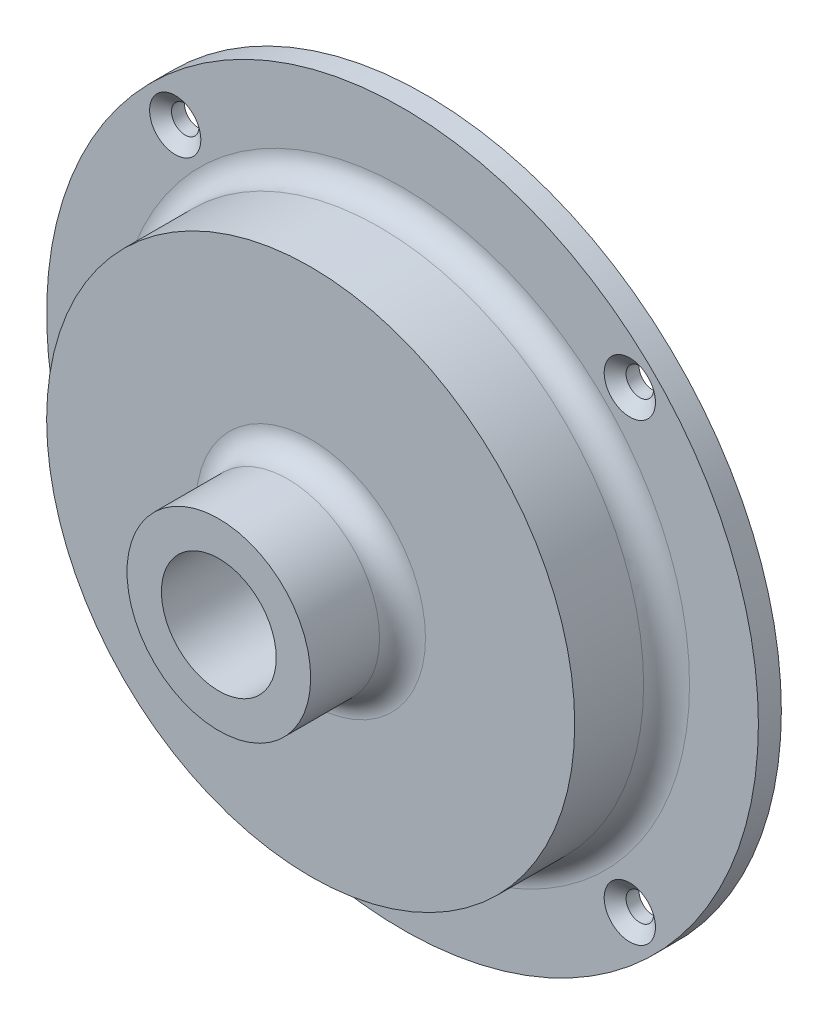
from build123d import *

# Parameters (mm, degrees)
SKETCH1_R                                         = 49.2125
BASE_EXTRUDE_DEPTH                                = 3.175
SKETCH2_R                                         = 36.5125
BOSS_EXTRUDE1_DEPTH                               = 12.7
SKETCH3_R                                         = 12.7
BOSS_EXTRUDE2_DEPTH                               = 12.7
FILLET1_R                                         = 3.175
SKETCH4_R                                         = 7.9375
CUT_EXTRUDE1_DEPTH                                = 76.23477213
CSK_FOR_6_FLAT_HEAD_MACHINE_SCREW_100_D           = 3.7973
CSK_FOR_6_FLAT_HEAD_MACHINE_SCREW_100_CSINK_D     = 7.0866
CSK_FOR_6_FLAT_HEAD_MACHINE_SCREW_100_CSINK_ANGLE = 100
CIRPATTERN2_COUNT                                 = 4


with BuildPart() as part:
    # Sketch1 → Base-Extrude (new body)
    with BuildSketch(Plane.XY):
        Circle(SKETCH1_R)
    extrude(amount=BASE_EXTRUDE_DEPTH)

    # Sketch2 → Boss-Extrude1 (add)
    with BuildSketch(Plane.XY.offset(3.175)):
        Circle(SKETCH2_R)
    extrude(amount=BOSS_EXTRUDE1_DEPTH)

    # Sketch3 → Boss-Extrude2 (add)
    with BuildSketch(Plane.XY.offset(15.875)):
        Circle(SKETCH3_R)
    extrude(amount=BOSS_EXTRUDE2_DEPTH)

    # Fillet1
    fillet1_edges = [part.edges().sort_by_distance(p)[0] for p in [
        (-36.5125, 0, 3.175),
        (-12.7, 0, 15.875),
    ]]
    fillet(fillet1_edges, radius=FILLET1_R)

    # Sketch4 → Cut-Extrude1 (cut, through all)
    with BuildSketch(Plane.XY.offset(28.575)):
        Circle(SKETCH4_R)
    extrude(amount=-CUT_EXTRUDE1_DEPTH, mode=Mode.SUBTRACT)

    # CSK for _6 Flat Head Machine Screw _100 (through all)
    with Locations(Plane.XY.offset(3.175)):
        with Locations((31.430896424, -31.430896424)):
            csk_for_6_flat_head_machine_screw_100 = CounterSinkHole(CSK_FOR_6_FLAT_HEAD_MACHINE_SCREW_100_D / 2, CSK_FOR_6_FLAT_HEAD_MACHINE_SCREW_100_CSINK_D / 2, counter_sink_angle=CSK_FOR_6_FLAT_HEAD_MACHINE_SCREW_100_CSINK_ANGLE)

    # CirPattern2: CSK for _6 Flat Head Machine Screw _100 ×4 about axis
    cirpattern2_axis = Axis((0, 0, 0), (0, 0, 1))
    for i in range(1, CIRPATTERN2_COUNT):
        add(csk_for_6_flat_head_machine_screw_100.rotate(cirpattern2_axis, i * 360 / CIRPATTERN2_COUNT), mode=Mode.SUBTRACT)


solid = part.part
